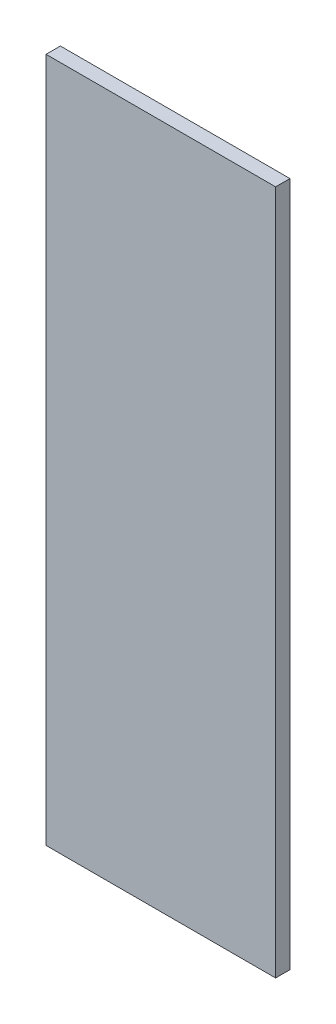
from build123d import *

# Parameters (mm, degrees)
SKETCH1_W      = 203.2
SKETCH1_H      = 606.425
EXTRUDE1_DEPTH = 12.7


with BuildPart() as part:
    # Sketch1 → Extrude1 (new body)
    with BuildSketch(Plane.XY):
        Rectangle(SKETCH1_W, SKETCH1_H)
    extrude(amount=EXTRUDE1_DEPTH)


solid = part.part
